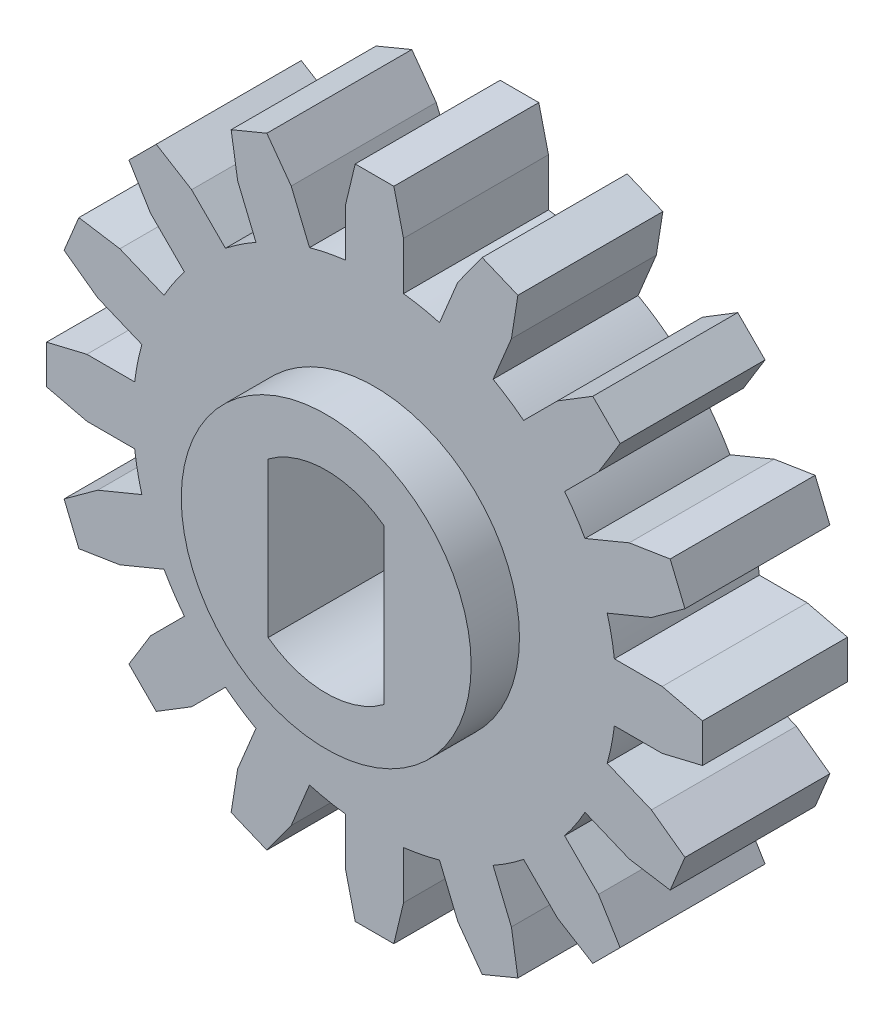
from build123d import *

# Parameters (mm, degrees)
SKETCH1_R           = 6.35
BOSS_EXTRUDE1_DEPTH = 3.81
SKETCH3_R           = 3.81
BOSS_EXTRUDE2_DEPTH = 1.27
BOSS_EXTRUDE3_START = 1.27
SKETCH4_R           = 3.81
BOSS_EXTRUDE3_DEPTH = 1.27
CUT_EXTRUDE2_DEPTH  = 11.998522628
BOSS_EXTRUDE4_DEPTH = 3.81


with BuildPart() as part:
    # Sketch1 → Boss-Extrude1 (new body)
    with BuildSketch(Plane.XY):
        with Locations(Location((0, 0, 0), (0, 0, 180))):
            Circle(SKETCH1_R)
    extrude(amount=BOSS_EXTRUDE1_DEPTH)

    # Sketch3 → Boss-Extrude2 (add)
    with BuildSketch(Plane.XY.offset(3.81)):
        Circle(SKETCH3_R)
    extrude(amount=BOSS_EXTRUDE2_DEPTH)

    # Sketch4 → Boss-Extrude3 (add)
    with BuildSketch(Plane(origin=(0, 0, 0), x_dir=(-1, 0, 0), z_dir=(0, 0, -1)).offset(BOSS_EXTRUDE3_START)):
        with Locations(Location((0, 0, 0), (0, 0, 180))):
            Circle(SKETCH4_R)
    extrude(amount=-BOSS_EXTRUDE3_DEPTH)

    # Sketch5 → Cut-Extrude2 (cut, through all)
    with BuildSketch(Plane(origin=(0, 0, -1.27), x_dir=(-1, 0, 0), z_dir=(0, 0, -1))):
        with BuildLine():
            Line((-1.524, 2.032), (-1.524, -2.032))
            ThreePointArc((-1.524, -2.032), (0, -2.54), (1.524, -2.032))
            Line((1.524, -2.032), (1.524, 2.032))
            ThreePointArc((1.524, 2.032), (0, 2.54), (-1.524, 2.032))
        make_face()
    extrude(amount=-CUT_EXTRUDE2_DEPTH, mode=Mode.SUBTRACT)

    # Sketch6 → Boss-Extrude4 (add)
    with BuildSketch(Plane.XY.offset(3.81)):
        with BuildLine():
            Line((-0.508, 8.621045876), (-0.762, 7.561150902))
            Line((-0.762, 7.561150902), (-0.762, 6.291150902))
            ThreePointArc((-0.762, 6.291150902), (0, 6.337130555), (0.762, 6.291150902))
            Line((0.762, 6.291150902), (0.762, 7.561150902))
            Line((0.762, 7.561150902), (0.508, 8.621045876))
            Line((0.508, 8.621045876), (-0.508, 8.621045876))
        make_face()
        with BuildLine():
            Line((2.189530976, 7.277197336), (1.703523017, 6.10387033))
            ThreePointArc((1.703523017, 6.10387033), (2.425114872, 5.854745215), (3.111515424, 5.520660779))
            Line((3.111515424, 5.520660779), (3.597523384, 6.693987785))
            Line((3.597523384, 6.693987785), (3.768462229, 7.77040465))
            Line((3.768462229, 7.77040465), (2.829800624, 8.159211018))
            Line((2.829800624, 8.159211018), (2.189530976, 7.277197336))
        make_face()
        with BuildLine():
            Line((4.807725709, 5.885356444), (3.909700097, 4.987330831))
            ThreePointArc((3.909700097, 4.987330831), (4.481027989, 4.481027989), (4.987330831, 3.909700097))
            Line((4.987330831, 3.909700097), (5.885356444, 4.807725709))
            Line((5.885356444, 4.807725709), (6.455210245, 5.736789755))
            Line((6.455210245, 5.736789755), (5.736789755, 6.455210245))
            Line((5.736789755, 6.455210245), (4.807725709, 5.885356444))
        make_face()
        with BuildLine():
            Line((6.693987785, 3.597523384), (5.520660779, 3.111515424))
            ThreePointArc((5.520660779, 3.111515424), (5.854745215, 2.425114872), (6.10387033, 1.703523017))
            Line((6.10387033, 1.703523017), (7.277197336, 2.189530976))
            Line((7.277197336, 2.189530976), (8.159211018, 2.829800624))
            Line((8.159211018, 2.829800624), (7.77040465, 3.768462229))
            Line((7.77040465, 3.768462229), (6.693987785, 3.597523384))
        make_face()
        with BuildLine():
            Line((7.561150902, 0.762), (6.291150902, 0.762))
            ThreePointArc((6.291150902, 0.762), (6.337130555, 0), (6.291150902, -0.762))
            Line((6.291150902, -0.762), (7.561150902, -0.762))
            Line((7.561150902, -0.762), (8.621045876, -0.508))
            Line((8.621045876, -0.508), (8.621045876, 0.508))
            Line((8.621045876, 0.508), (7.561150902, 0.762))
        make_face()
        with BuildLine():
            Line((7.277197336, -2.189530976), (6.10387033, -1.703523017))
            ThreePointArc((6.10387033, -1.703523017), (5.854745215, -2.425114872), (5.520660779, -3.111515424))
            Line((5.520660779, -3.111515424), (6.693987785, -3.597523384))
            Line((6.693987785, -3.597523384), (7.77040465, -3.768462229))
            Line((7.77040465, -3.768462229), (8.159211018, -2.829800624))
            Line((8.159211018, -2.829800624), (7.277197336, -2.189530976))
        make_face()
        with BuildLine():
            Line((5.885356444, -4.807725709), (4.987330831, -3.909700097))
            ThreePointArc((4.987330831, -3.909700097), (4.481027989, -4.481027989), (3.909700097, -4.987330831))
            Line((3.909700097, -4.987330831), (4.807725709, -5.885356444))
            Line((4.807725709, -5.885356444), (5.736789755, -6.455210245))
            Line((5.736789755, -6.455210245), (6.455210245, -5.736789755))
            Line((6.455210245, -5.736789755), (5.885356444, -4.807725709))
        make_face()
        with BuildLine():
            Line((3.597523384, -6.693987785), (3.111515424, -5.520660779))
            ThreePointArc((3.111515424, -5.520660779), (2.425114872, -5.854745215), (1.703523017, -6.10387033))
            Line((1.703523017, -6.10387033), (2.189530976, -7.277197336))
            Line((2.189530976, -7.277197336), (2.829800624, -8.159211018))
            Line((2.829800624, -8.159211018), (3.768462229, -7.77040465))
            Line((3.768462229, -7.77040465), (3.597523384, -6.693987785))
        make_face()
        with BuildLine():
            Line((0.762, -7.561150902), (0.762, -6.291150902))
            ThreePointArc((0.762, -6.291150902), (0, -6.337130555), (-0.762, -6.291150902))
            Line((-0.762, -6.291150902), (-0.762, -7.561150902))
            Line((-0.762, -7.561150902), (-0.508, -8.621045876))
            Line((-0.508, -8.621045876), (0.508, -8.621045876))
            Line((0.508, -8.621045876), (0.762, -7.561150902))
        make_face()
        with BuildLine():
            Line((-2.189530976, -7.277197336), (-1.703523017, -6.10387033))
            ThreePointArc((-1.703523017, -6.10387033), (-2.425114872, -5.854745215), (-3.111515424, -5.520660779))
            Line((-3.111515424, -5.520660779), (-3.597523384, -6.693987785))
            Line((-3.597523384, -6.693987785), (-3.768462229, -7.77040465))
            Line((-3.768462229, -7.77040465), (-2.829800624, -8.159211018))
            Line((-2.829800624, -8.159211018), (-2.189530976, -7.277197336))
        make_face()
        with BuildLine():
            Line((-4.807725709, -5.885356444), (-3.909700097, -4.987330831))
            ThreePointArc((-3.909700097, -4.987330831), (-4.481027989, -4.481027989), (-4.987330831, -3.909700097))
            Line((-4.987330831, -3.909700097), (-5.885356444, -4.807725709))
            Line((-5.885356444, -4.807725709), (-6.455210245, -5.736789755))
            Line((-6.455210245, -5.736789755), (-5.736789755, -6.455210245))
            Line((-5.736789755, -6.455210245), (-4.807725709, -5.885356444))
        make_face()
        with BuildLine():
            Line((-6.693987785, -3.597523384), (-5.520660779, -3.111515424))
            ThreePointArc((-5.520660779, -3.111515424), (-5.854745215, -2.425114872), (-6.10387033, -1.703523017))
            Line((-6.10387033, -1.703523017), (-7.277197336, -2.189530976))
            Line((-7.277197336, -2.189530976), (-8.159211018, -2.829800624))
            Line((-8.159211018, -2.829800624), (-7.77040465, -3.768462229))
            Line((-7.77040465, -3.768462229), (-6.693987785, -3.597523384))
        make_face()
        with BuildLine():
            Line((-7.561150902, -0.762), (-6.291150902, -0.762))
            ThreePointArc((-6.291150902, -0.762), (-6.337130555, 0), (-6.291150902, 0.762))
            Line((-6.291150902, 0.762), (-7.561150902, 0.762))
            Line((-7.561150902, 0.762), (-8.621045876, 0.508))
            Line((-8.621045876, 0.508), (-8.621045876, -0.508))
            Line((-8.621045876, -0.508), (-7.561150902, -0.762))
        make_face()
        with BuildLine():
            Line((-7.277197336, 2.189530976), (-6.10387033, 1.703523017))
            ThreePointArc((-6.10387033, 1.703523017), (-5.854745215, 2.425114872), (-5.520660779, 3.111515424))
            Line((-5.520660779, 3.111515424), (-6.693987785, 3.597523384))
            Line((-6.693987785, 3.597523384), (-7.77040465, 3.768462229))
            Line((-7.77040465, 3.768462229), (-8.159211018, 2.829800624))
            Line((-8.159211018, 2.829800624), (-7.277197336, 2.189530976))
        make_face()
        with BuildLine():
            Line((-5.885356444, 4.807725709), (-4.987330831, 3.909700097))
            ThreePointArc((-4.987330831, 3.909700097), (-4.481027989, 4.481027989), (-3.909700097, 4.987330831))
            Line((-3.909700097, 4.987330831), (-4.807725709, 5.885356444))
            Line((-4.807725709, 5.885356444), (-5.736789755, 6.455210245))
            Line((-5.736789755, 6.455210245), (-6.455210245, 5.736789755))
            Line((-6.455210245, 5.736789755), (-5.885356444, 4.807725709))
        make_face()
        with BuildLine():
            Line((-3.597523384, 6.693987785), (-3.111515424, 5.520660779))
            ThreePointArc((-3.111515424, 5.520660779), (-2.425114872, 5.854745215), (-1.703523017, 6.10387033))
            Line((-1.703523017, 6.10387033), (-2.189530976, 7.277197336))
            Line((-2.189530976, 7.277197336), (-2.829800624, 8.159211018))
            Line((-2.829800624, 8.159211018), (-3.768462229, 7.77040465))
            Line((-3.768462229, 7.77040465), (-3.597523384, 6.693987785))
        make_face()
    extrude(amount=-BOSS_EXTRUDE4_DEPTH)


solid = part.part
